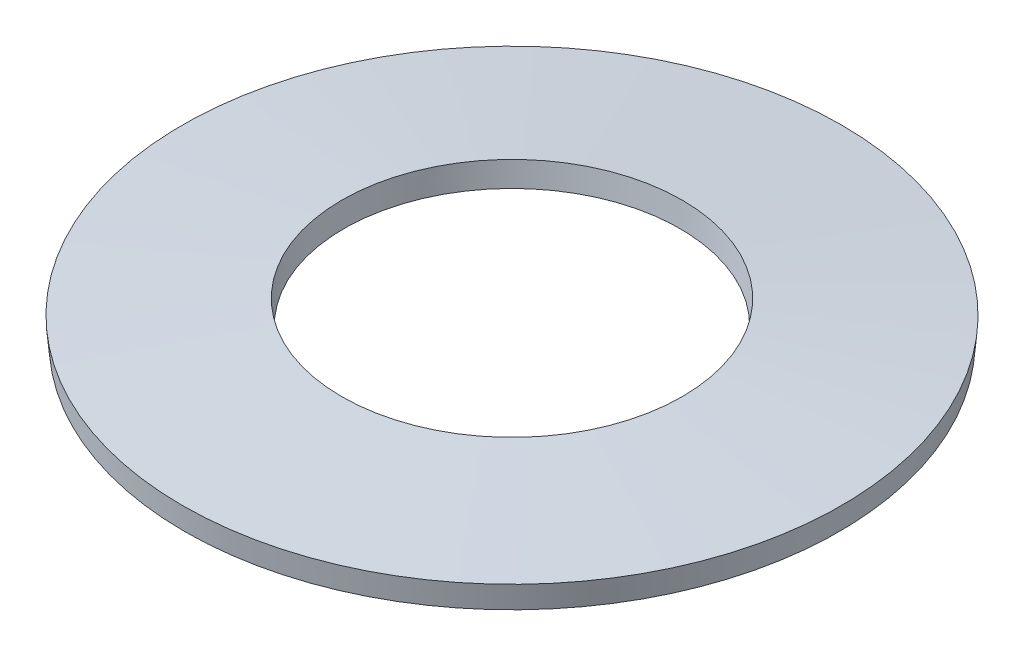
from build123d import *


with BuildPart() as part:
    # Sketch1 → Revolve1 (revolve)
    with BuildSketch(Plane.XY, mode=Mode.PRIVATE) as revolve1_sk:
        Polygon((3.280221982, 0), (6.35, -0.281307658), (6.308278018, -0.7366), (3.2385, -0.455292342), align=None)
    revolve(revolve1_sk.sketch.rotate(Axis((0, 0, 0), (0, -1, 0)), 90), axis=Axis((0, 0, 0), (0, -1, 0)))


solid = part.part
